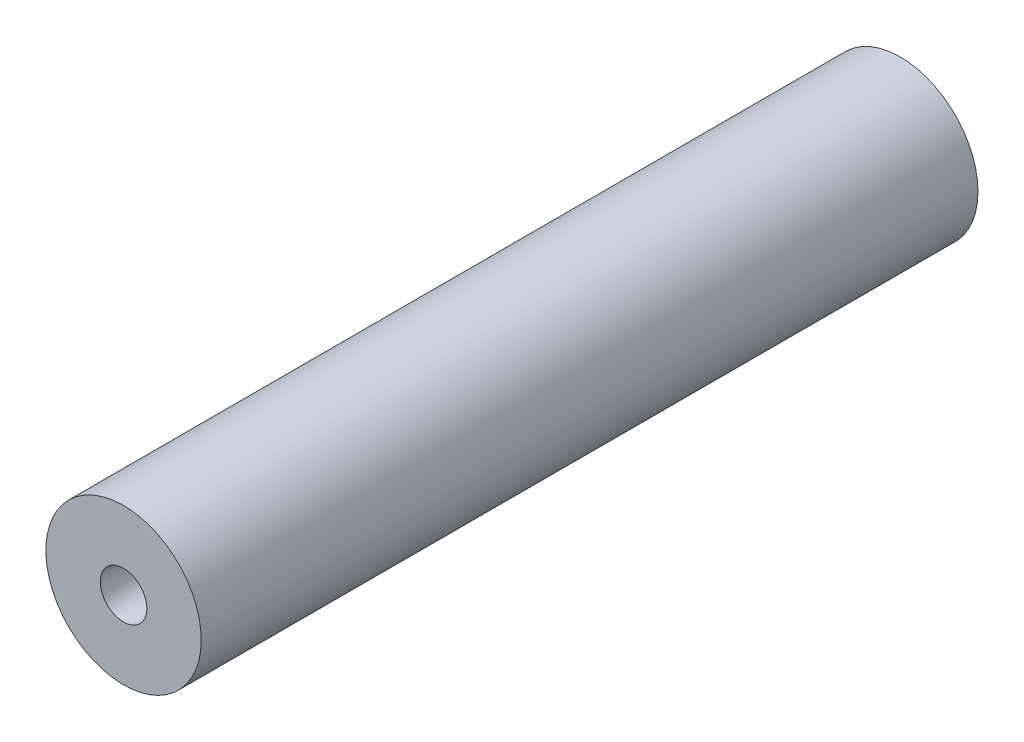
from build123d import *

# Parameters (mm, degrees)
ESQUISSE1_R        = 10
ESQUISSE1_R_2      = 3
BOSS_EXTRU_1_DEPTH = 100


with BuildPart() as part:
    # Esquisse1 → Boss.-Extru.1 (new body)
    with BuildSketch(Plane.XY):
        Circle(ESQUISSE1_R)
        Circle(ESQUISSE1_R_2, mode=Mode.SUBTRACT)
    extrude(amount=BOSS_EXTRU_1_DEPTH)


solid = part.part
